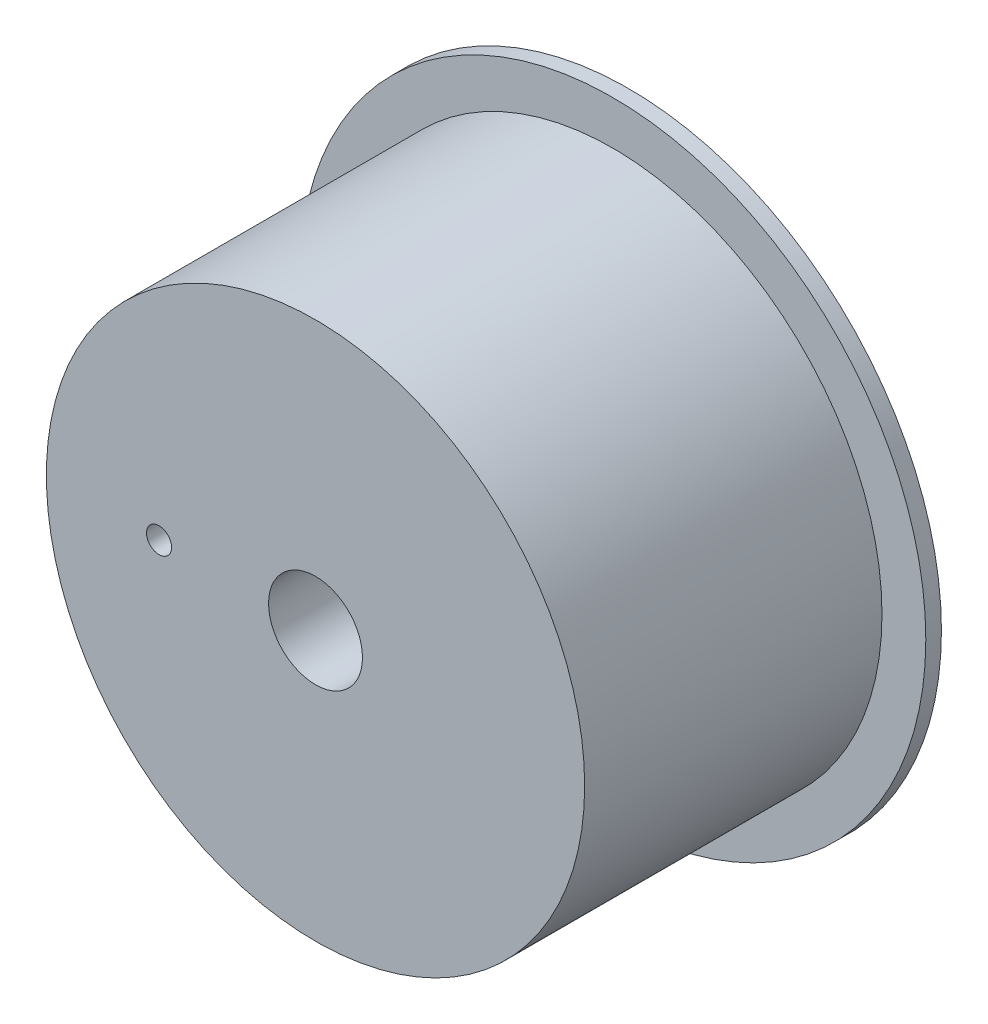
ISO-10303-21;
HEADER;
FILE_DESCRIPTION(('STEP AP214'),'2;1');
FILE_NAME('part.step','',(''),(''),'','','');
FILE_SCHEMA(('AUTOMOTIVE_DESIGN { 1 0 10303 214 1 1 1 1 }'));
ENDSEC;
DATA;
#1=APPLICATION_CONTEXT('core data for automotive mechanical design processes');
#2=APPLICATION_PROTOCOL_DEFINITION('international standard','automotive_design',2000,#1);
#3=PRODUCT_CONTEXT('',#1,'mechanical');
#4=PRODUCT('Part','Part','',(#3));
#5=PRODUCT_RELATED_PRODUCT_CATEGORY('part','',(#4));
#6=PRODUCT_DEFINITION_FORMATION('','',#4);
#7=PRODUCT_DEFINITION_CONTEXT('part definition',#1,'design');
#8=PRODUCT_DEFINITION('design','',#6,#7);
#9=PRODUCT_DEFINITION_SHAPE('','',#8);
#10=(LENGTH_UNIT() NAMED_UNIT(*) SI_UNIT(.MILLI.,.METRE.));
#11=(NAMED_UNIT(*) PLANE_ANGLE_UNIT() SI_UNIT($,.RADIAN.));
#12=(NAMED_UNIT(*) SI_UNIT($,.STERADIAN.) SOLID_ANGLE_UNIT());
#13=UNCERTAINTY_MEASURE_WITH_UNIT(LENGTH_MEASURE(1.E-05),#10,'distance_accuracy_value','');
#14=(GEOMETRIC_REPRESENTATION_CONTEXT(3) GLOBAL_UNCERTAINTY_ASSIGNED_CONTEXT((#13)) GLOBAL_UNIT_ASSIGNED_CONTEXT((#10,
#11,#12)) REPRESENTATION_CONTEXT('',''));
#15=CARTESIAN_POINT('',(0.,0.,0.));
#16=DIRECTION('',(0.,0.,1.));
#17=DIRECTION('',(1.,0.,0.));
#18=AXIS2_PLACEMENT_3D('',#15,#16,#17);
#19=CARTESIAN_POINT('',(0.,0.,0.5));
#20=DIRECTION('',(0.,0.,-1.));
#21=DIRECTION('',(-1.,0.,0.));
#22=AXIS2_PLACEMENT_3D('',#19,#20,#21);
#23=CYLINDRICAL_SURFACE('',#22,10.);
#24=CARTESIAN_POINT('',(0.,0.,0.5));
#25=DIRECTION('',(0.,0.,1.));
#26=DIRECTION('',(1.,0.,0.));
#27=AXIS2_PLACEMENT_3D('',#24,#25,#26);
#28=CIRCLE('',#27,10.);
#29=CARTESIAN_POINT('',(10.,0.,0.5));
#30=VERTEX_POINT('',#29);
#31=EDGE_CURVE('E10',#30,#30,#28,.T.);
#32=ORIENTED_EDGE('',*,*,#31,.F.);
#33=EDGE_LOOP('',(#32));
#34=FACE_BOUND('',#33,.T.);
#35=CARTESIAN_POINT('',(0.,0.,0.));
#36=DIRECTION('',(0.,0.,1.));
#37=DIRECTION('',(1.,0.,0.));
#38=AXIS2_PLACEMENT_3D('',#35,#36,#37);
#39=CIRCLE('',#38,10.);
#40=CARTESIAN_POINT('',(10.,0.,0.));
#41=VERTEX_POINT('',#40);
#42=EDGE_CURVE('E35',#41,#41,#39,.T.);
#43=ORIENTED_EDGE('',*,*,#42,.T.);
#44=EDGE_LOOP('',(#43));
#45=FACE_BOUND('',#44,.T.);
#46=ADVANCED_FACE('F32',(#34,#45),#23,.T.);
#47=CARTESIAN_POINT('',(0.,0.,0.5));
#48=DIRECTION('',(0.,0.,1.));
#49=DIRECTION('',(1.,0.,0.));
#50=AXIS2_PLACEMENT_3D('',#47,#48,#49);
#51=PLANE('',#50);
#52=CARTESIAN_POINT('',(0.,0.,0.5));
#53=DIRECTION('',(0.,0.,1.));
#54=DIRECTION('',(1.,0.,0.));
#55=AXIS2_PLACEMENT_3D('',#52,#53,#54);
#56=CIRCLE('',#55,8.6);
#57=CARTESIAN_POINT('',(8.6,0.,0.5));
#58=VERTEX_POINT('',#57);
#59=EDGE_CURVE('E44',#58,#58,#56,.T.);
#60=ORIENTED_EDGE('',*,*,#59,.F.);
#61=EDGE_LOOP('',(#60));
#62=FACE_BOUND('',#61,.T.);
#63=ORIENTED_EDGE('',*,*,#31,.T.);
#64=EDGE_LOOP('',(#63));
#65=FACE_BOUND('',#64,.T.);
#66=ADVANCED_FACE('F97',(#62,#65),#51,.T.);
#67=CARTESIAN_POINT('',(0.,0.,0.));
#68=DIRECTION('',(0.,0.,1.));
#69=DIRECTION('',(1.,0.,0.));
#70=AXIS2_PLACEMENT_3D('',#67,#68,#69);
#71=PLANE('',#70);
#72=CARTESIAN_POINT('',(0.,0.,0.));
#73=DIRECTION('',(0.,0.,-1.));
#74=DIRECTION('',(-1.,0.,0.));
#75=AXIS2_PLACEMENT_3D('',#72,#73,#74);
#76=CIRCLE('',#75,8.);
#77=CARTESIAN_POINT('',(-8.,0.,0.));
#78=VERTEX_POINT('',#77);
#79=EDGE_CURVE('E50',#78,#78,#76,.T.);
#80=ORIENTED_EDGE('',*,*,#79,.F.);
#81=EDGE_LOOP('',(#80));
#82=FACE_BOUND('',#81,.T.);
#83=ORIENTED_EDGE('',*,*,#42,.F.);
#84=EDGE_LOOP('',(#83));
#85=FACE_BOUND('',#84,.T.);
#86=ADVANCED_FACE('F93',(#82,#85),#71,.F.);
#87=CARTESIAN_POINT('',(0.,0.,10.));
#88=DIRECTION('',(0.,0.,-1.));
#89=DIRECTION('',(-1.,0.,0.));
#90=AXIS2_PLACEMENT_3D('',#87,#88,#89);
#91=CYLINDRICAL_SURFACE('',#90,8.6);
#92=CARTESIAN_POINT('',(0.,0.,10.));
#93=DIRECTION('',(0.,0.,1.));
#94=DIRECTION('',(1.,0.,0.));
#95=AXIS2_PLACEMENT_3D('',#92,#93,#94);
#96=CIRCLE('',#95,8.6);
#97=CARTESIAN_POINT('',(8.6,0.,10.));
#98=VERTEX_POINT('',#97);
#99=EDGE_CURVE('E42',#98,#98,#96,.T.);
#100=ORIENTED_EDGE('',*,*,#99,.F.);
#101=EDGE_LOOP('',(#100));
#102=FACE_BOUND('',#101,.T.);
#103=ORIENTED_EDGE('',*,*,#59,.T.);
#104=EDGE_LOOP('',(#103));
#105=FACE_BOUND('',#104,.T.);
#106=ADVANCED_FACE('F96',(#102,#105),#91,.T.);
#107=CARTESIAN_POINT('',(0.,0.,10.));
#108=DIRECTION('',(0.,0.,1.));
#109=DIRECTION('',(1.,0.,0.));
#110=AXIS2_PLACEMENT_3D('',#107,#108,#109);
#111=PLANE('',#110);
#112=CARTESIAN_POINT('',(-5.,0.,10.));
#113=DIRECTION('',(0.,0.,1.));
#114=DIRECTION('',(1.,0.,0.));
#115=AXIS2_PLACEMENT_3D('',#112,#113,#114);
#116=CIRCLE('',#115,0.399999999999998);
#117=CARTESIAN_POINT('',(-4.6,0.,10.));
#118=VERTEX_POINT('',#117);
#119=EDGE_CURVE('E67',#118,#118,#116,.T.);
#120=ORIENTED_EDGE('',*,*,#119,.F.);
#121=EDGE_LOOP('',(#120));
#122=FACE_BOUND('',#121,.T.);
#123=CARTESIAN_POINT('',(0.,0.,10.));
#124=DIRECTION('',(0.,0.,1.));
#125=DIRECTION('',(1.,0.,0.));
#126=AXIS2_PLACEMENT_3D('',#123,#124,#125);
#127=CIRCLE('',#126,1.5);
#128=CARTESIAN_POINT('',(1.5,0.,10.));
#129=VERTEX_POINT('',#128);
#130=EDGE_CURVE('E59',#129,#129,#127,.T.);
#131=ORIENTED_EDGE('',*,*,#130,.F.);
#132=EDGE_LOOP('',(#131));
#133=FACE_BOUND('',#132,.T.);
#134=ORIENTED_EDGE('',*,*,#99,.T.);
#135=EDGE_LOOP('',(#134));
#136=FACE_BOUND('',#135,.T.);
#137=ADVANCED_FACE('F89',(#122,#133,#136),#111,.T.);
#138=CARTESIAN_POINT('',(0.,0.,6.));
#139=DIRECTION('',(0.,0.,-1.));
#140=DIRECTION('',(-1.,0.,0.));
#141=AXIS2_PLACEMENT_3D('',#138,#139,#140);
#142=CYLINDRICAL_SURFACE('',#141,8.);
#143=CARTESIAN_POINT('',(0.,0.,6.));
#144=DIRECTION('',(0.,0.,-1.));
#145=DIRECTION('',(-1.,0.,0.));
#146=AXIS2_PLACEMENT_3D('',#143,#144,#145);
#147=CIRCLE('',#146,8.);
#148=CARTESIAN_POINT('',(-8.,0.,6.));
#149=VERTEX_POINT('',#148);
#150=EDGE_CURVE('E47',#149,#149,#147,.T.);
#151=ORIENTED_EDGE('',*,*,#150,.F.);
#152=EDGE_LOOP('',(#151));
#153=FACE_BOUND('',#152,.T.);
#154=ORIENTED_EDGE('',*,*,#79,.T.);
#155=EDGE_LOOP('',(#154));
#156=FACE_BOUND('',#155,.T.);
#157=ADVANCED_FACE('F81',(#153,#156),#142,.F.);
#158=CARTESIAN_POINT('',(0.,0.,6.));
#159=DIRECTION('',(0.,0.,-1.));
#160=DIRECTION('',(-1.,0.,0.));
#161=AXIS2_PLACEMENT_3D('',#158,#159,#160);
#162=PLANE('',#161);
#163=CARTESIAN_POINT('',(-5.,0.,6.));
#164=DIRECTION('',(0.,0.,-1.));
#165=DIRECTION('',(-1.,0.,0.));
#166=AXIS2_PLACEMENT_3D('',#163,#164,#165);
#167=CIRCLE('',#166,0.399999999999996);
#168=CARTESIAN_POINT('',(-5.4,0.,6.));
#169=VERTEX_POINT('',#168);
#170=EDGE_CURVE('E70',#169,#169,#167,.T.);
#171=ORIENTED_EDGE('',*,*,#170,.F.);
#172=EDGE_LOOP('',(#171));
#173=FACE_BOUND('',#172,.T.);
#174=CARTESIAN_POINT('',(0.,0.,6.));
#175=DIRECTION('',(0.,0.,-1.));
#176=DIRECTION('',(-1.,0.,0.));
#177=AXIS2_PLACEMENT_3D('',#174,#175,#176);
#178=CIRCLE('',#177,3.);
#179=CARTESIAN_POINT('',(-3.,0.,6.));
#180=VERTEX_POINT('',#179);
#181=EDGE_CURVE('E53',#180,#180,#178,.T.);
#182=ORIENTED_EDGE('',*,*,#181,.F.);
#183=EDGE_LOOP('',(#182));
#184=FACE_BOUND('',#183,.T.);
#185=ORIENTED_EDGE('',*,*,#150,.T.);
#186=EDGE_LOOP('',(#185));
#187=FACE_BOUND('',#186,.T.);
#188=ADVANCED_FACE('F77',(#173,#184,#187),#162,.T.);
#189=CARTESIAN_POINT('',(0.,0.,6.));
#190=DIRECTION('',(0.,0.,-1.));
#191=DIRECTION('',(-1.,0.,0.));
#192=AXIS2_PLACEMENT_3D('',#189,#190,#191);
#193=CYLINDRICAL_SURFACE('',#192,3.);
#194=ORIENTED_EDGE('',*,*,#181,.T.);
#195=EDGE_LOOP('',(#194));
#196=FACE_BOUND('',#195,.T.);
#197=CARTESIAN_POINT('',(0.,0.,0.));
#198=DIRECTION('',(0.,0.,-1.));
#199=DIRECTION('',(-1.,0.,0.));
#200=AXIS2_PLACEMENT_3D('',#197,#198,#199);
#201=CIRCLE('',#200,3.);
#202=CARTESIAN_POINT('',(-3.,0.,0.));
#203=VERTEX_POINT('',#202);
#204=EDGE_CURVE('E56',#203,#203,#201,.T.);
#205=ORIENTED_EDGE('',*,*,#204,.F.);
#206=EDGE_LOOP('',(#205));
#207=FACE_BOUND('',#206,.T.);
#208=ADVANCED_FACE('F80',(#196,#207),#193,.T.);
#209=CARTESIAN_POINT('',(0.,0.,0.));
#210=DIRECTION('',(0.,0.,-1.));
#211=DIRECTION('',(-1.,0.,0.));
#212=AXIS2_PLACEMENT_3D('',#209,#210,#211);
#213=CIRCLE('',#212,1.5);
#214=CARTESIAN_POINT('',(-1.5,0.,0.));
#215=VERTEX_POINT('',#214);
#216=EDGE_CURVE('E64',#215,#215,#213,.T.);
#217=ORIENTED_EDGE('',*,*,#216,.F.);
#218=EDGE_LOOP('',(#217));
#219=FACE_BOUND('',#218,.T.);
#220=ORIENTED_EDGE('',*,*,#204,.T.);
#221=EDGE_LOOP('',(#220));
#222=FACE_BOUND('',#221,.T.);
#223=ADVANCED_FACE('F98',(#219,#222),#71,.F.);
#224=CARTESIAN_POINT('',(0.,0.,0.));
#225=DIRECTION('',(0.,0.,-1.));
#226=DIRECTION('',(-1.,0.,0.));
#227=AXIS2_PLACEMENT_3D('',#224,#225,#226);
#228=CYLINDRICAL_SURFACE('',#227,1.5);
#229=ORIENTED_EDGE('',*,*,#216,.T.);
#230=EDGE_LOOP('',(#229));
#231=FACE_BOUND('',#230,.T.);
#232=ORIENTED_EDGE('',*,*,#130,.T.);
#233=EDGE_LOOP('',(#232));
#234=FACE_BOUND('',#233,.T.);
#235=ADVANCED_FACE('F121',(#231,#234),#228,.F.);
#236=CARTESIAN_POINT('',(-5.,0.,6.));
#237=DIRECTION('',(0.,0.,-1.));
#238=DIRECTION('',(-1.,0.,0.));
#239=AXIS2_PLACEMENT_3D('',#236,#237,#238);
#240=CYLINDRICAL_SURFACE('',#239,0.399999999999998);
#241=ORIENTED_EDGE('',*,*,#170,.T.);
#242=EDGE_LOOP('',(#241));
#243=FACE_BOUND('',#242,.T.);
#244=ORIENTED_EDGE('',*,*,#119,.T.);
#245=EDGE_LOOP('',(#244));
#246=FACE_BOUND('',#245,.T.);
#247=ADVANCED_FACE('F74',(#243,#246),#240,.F.);
#248=CLOSED_SHELL('',(#46,#66,#86,#106,#137,#157,#188,#208,#223,#235,#247));
#249=MANIFOLD_SOLID_BREP('B2',#248);
#250=ADVANCED_BREP_SHAPE_REPRESENTATION('',(#18,#249),#14);
#251=SHAPE_DEFINITION_REPRESENTATION(#9,#250);
ENDSEC;
END-ISO-10303-21;
